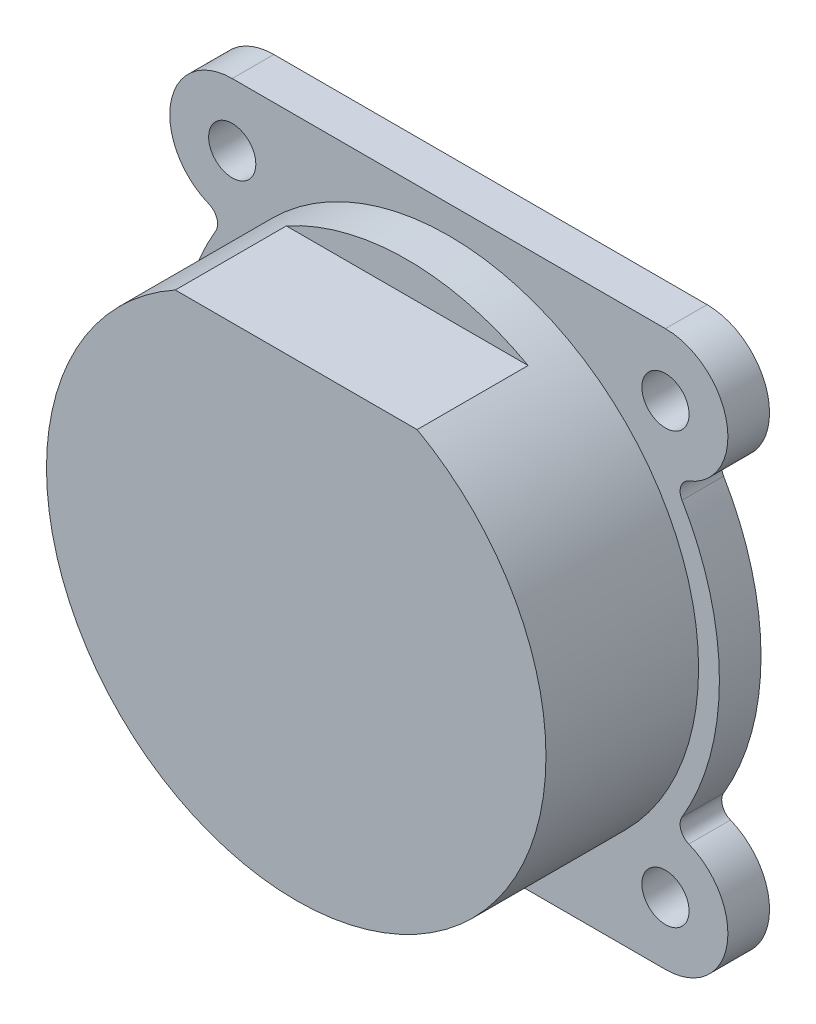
from build123d import *

# Parameters (mm, degrees)
BASE_EXTRUSION_DEPTH    = 14
ESQUISSE2_R             = 40
ESQUISSE2_R_2           = 18
ENL_V_MAT_EXTRU_1_DEPTH = 11
PER_AGE1_D              = 3.4
PER_AGE1_DEPTH          = 80
PER_AGE1_TIP            = 1.021463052
ESQUISSE5_R             = 15
ENL_V_MAT_EXTRU_2_DEPTH = 11
ESQUISSE6_W             = 40
ESQUISSE6_H             = 8
ENL_V_MAT_EXTRU_3_DEPTH = 44.342530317


with BuildPart() as part:
    # Esquisse1 → Base-Extrusion (new body)
    with BuildSketch(Plane.XY):
        with BuildLine():
            Line((15.612495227, 19.999999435), (-15.612495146, 20.000000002))
            ThreePointArc((-15.612495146, 20.000000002), (-20.030296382, 16.356172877), (-17.293563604, 11.325791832))
            ThreePointArc((-17.293563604, 11.325791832), (-16.720441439, 10.720328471), (-16.805322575, 9.890961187))
            ThreePointArc((-16.805322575, 9.890961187), (-19.499999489, -4.31e-07), (-16.805322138, -9.89096193))
            ThreePointArc((-16.805322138, -9.89096193), (-16.720440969, -10.720328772), (-17.293562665, -11.325791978))
            ThreePointArc((-17.293562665, -11.325791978), (-20.030295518, -16.356172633), (-15.612495, -19.999999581))
            Line((-15.612495, -19.999999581), (15.612495, -19.999999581))
            ThreePointArc((15.612495, -19.999999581), (20.030295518, -16.356172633), (17.293562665, -11.325791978))
            ThreePointArc((17.293562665, -11.325791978), (16.720440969, -10.720328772), (16.805322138, -9.89096193))
            ThreePointArc((16.805322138, -9.89096193), (19.499999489, -4.31e-07), (16.805322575, 9.890961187))
            ThreePointArc((16.805322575, 9.890961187), (16.720441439, 10.720328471), (17.293563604, 11.325791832))
            ThreePointArc((17.293563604, 11.325791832), (20.030296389, 16.356172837), (15.612495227, 19.999999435))
        make_face()
    extrude(amount=BASE_EXTRUSION_DEPTH)

    # Esquisse2 → Enl_v. mat.-Extru.1 (cut)
    with BuildSketch(Plane.XY.offset(14)):
        Circle(ESQUISSE2_R)
        Circle(ESQUISSE2_R_2, mode=Mode.SUBTRACT)
    extrude(amount=-ENL_V_MAT_EXTRU_1_DEPTH, mode=Mode.SUBTRACT)

    # Per_age1
    with Locations(Plane.XY.offset(3)):
        with Locations((15.612495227, 15.499999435), (15.612494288, -15.499999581), (-15.612495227, 15.499999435), (-15.612494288, -15.499999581)):
            Hole(PER_AGE1_D / 2, depth=PER_AGE1_DEPTH)
            with Locations((0, 0, -(PER_AGE1_DEPTH + PER_AGE1_TIP / 2))):  # 118° drill point
                Cone(0, PER_AGE1_D / 2, PER_AGE1_TIP, mode=Mode.SUBTRACT)

    # Esquisse5 → Enl_v. mat.-Extru.2 (cut)
    with BuildSketch(Plane(origin=(0, 0, 0), x_dir=(-1, 0, 0), z_dir=(0, 0, -1))):
        Circle(ESQUISSE5_R)
    extrude(amount=-ENL_V_MAT_EXTRU_2_DEPTH, mode=Mode.SUBTRACT)

    # Esquisse6 → Enl_v. mat.-Extru.3 (cut, through all)
    with BuildSketch(Plane(origin=(0, 15.75, 0), x_dir=(-1, 0, 0), z_dir=(0, 1, 0))):
        with Locations((0, 10)):
            Rectangle(ESQUISSE6_W, ESQUISSE6_H)
    extrude(amount=ENL_V_MAT_EXTRU_3_DEPTH, mode=Mode.SUBTRACT)


solid = part.part
